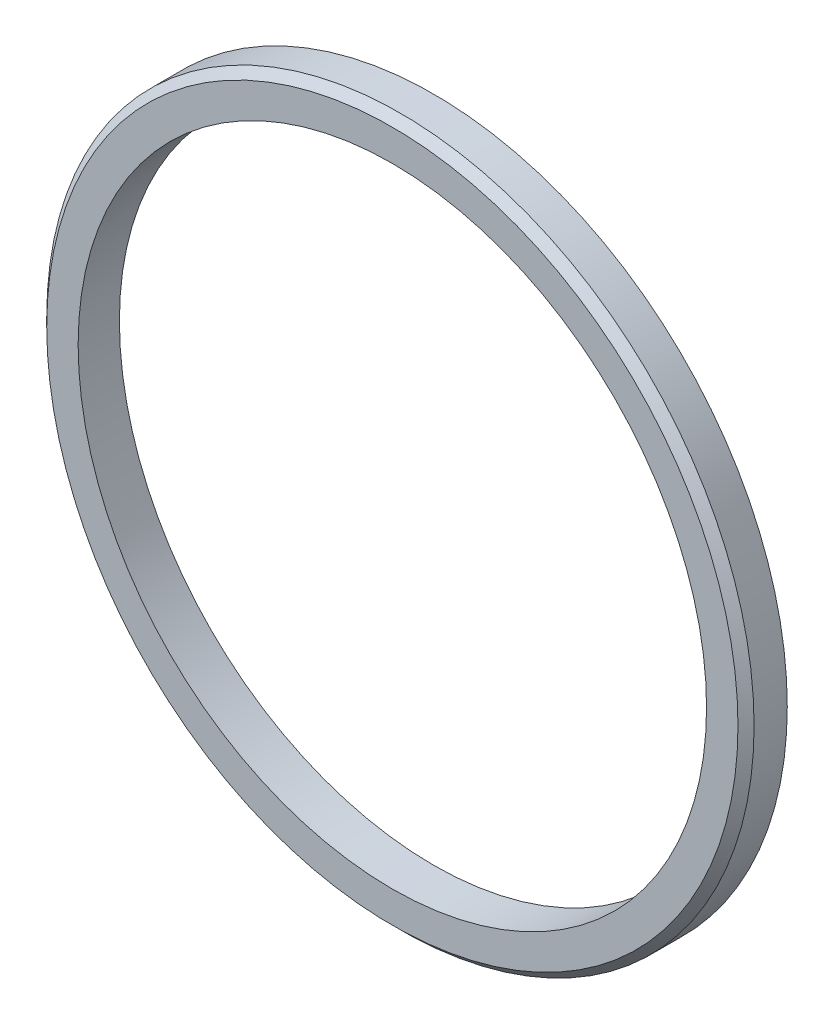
from build123d import *

# Parameters (mm, degrees)
SKETCH1_R           = 10.975
SKETCH1_R_2         = 9.75
BOSS_EXTRUDE1_DEPTH = 1.28
CHAMFER1_SIZE       = 0.25


with BuildPart() as part:
    # Sketch1 → Boss-Extrude1 (new body)
    with BuildSketch(Plane.XY):
        with Locations(Location((0, 0, 0), (0, 0, 180))):
            Circle(SKETCH1_R)
        with Locations(Location((0, 0, 0), (0, 0, 180))):
            Circle(SKETCH1_R_2, mode=Mode.SUBTRACT)
    extrude(amount=BOSS_EXTRUDE1_DEPTH)

    # Chamfer1
    chamfer1_edges = [part.edges().sort_by_distance(p)[0] for p in [
        (10.975, 0, 1.28),
    ]]
    chamfer(chamfer1_edges, length=CHAMFER1_SIZE)


solid = part.part
